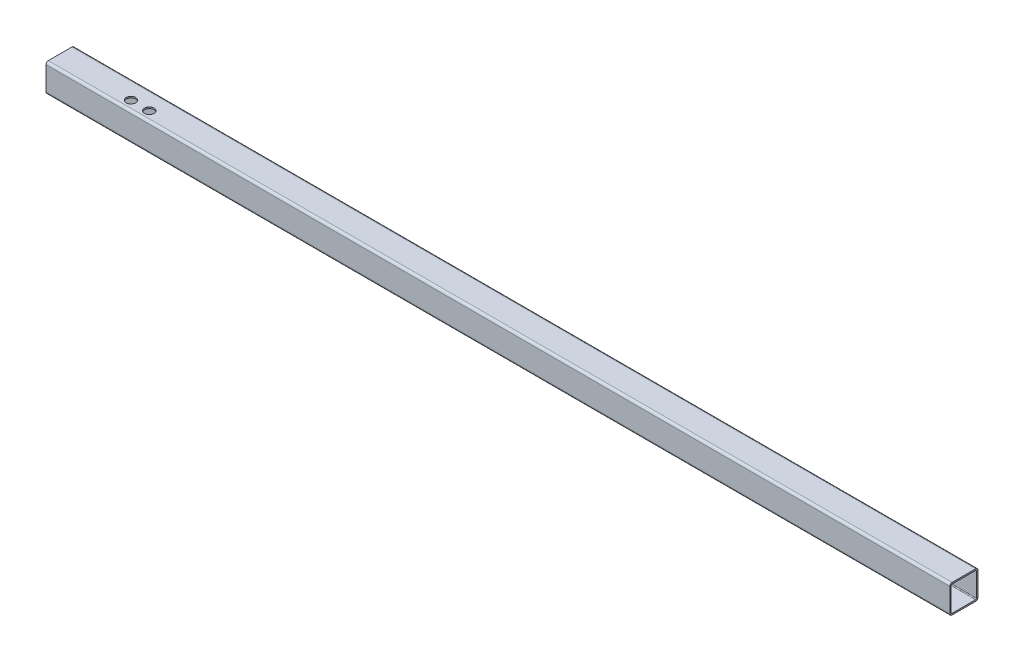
ISO-10303-21;
HEADER;
FILE_DESCRIPTION(('STEP AP214'),'2;1');
FILE_NAME('part.step','',(''),(''),'','','');
FILE_SCHEMA(('AUTOMOTIVE_DESIGN { 1 0 10303 214 1 1 1 1 }'));
ENDSEC;
DATA;
#1=APPLICATION_CONTEXT('core data for automotive mechanical design processes');
#2=APPLICATION_PROTOCOL_DEFINITION('international standard','automotive_design',2000,#1);
#3=PRODUCT_CONTEXT('',#1,'mechanical');
#4=PRODUCT('Part','Part','',(#3));
#5=PRODUCT_RELATED_PRODUCT_CATEGORY('part','',(#4));
#6=PRODUCT_DEFINITION_FORMATION('','',#4);
#7=PRODUCT_DEFINITION_CONTEXT('part definition',#1,'design');
#8=PRODUCT_DEFINITION('design','',#6,#7);
#9=PRODUCT_DEFINITION_SHAPE('','',#8);
#10=(LENGTH_UNIT() NAMED_UNIT(*) SI_UNIT(.MILLI.,.METRE.));
#11=(NAMED_UNIT(*) PLANE_ANGLE_UNIT() SI_UNIT($,.RADIAN.));
#12=(NAMED_UNIT(*) SI_UNIT($,.STERADIAN.) SOLID_ANGLE_UNIT());
#13=UNCERTAINTY_MEASURE_WITH_UNIT(LENGTH_MEASURE(1.E-05),#10,'distance_accuracy_value','');
#14=(GEOMETRIC_REPRESENTATION_CONTEXT(3) GLOBAL_UNCERTAINTY_ASSIGNED_CONTEXT((#13)) GLOBAL_UNIT_ASSIGNED_CONTEXT((#10,
#11,#12)) REPRESENTATION_CONTEXT('',''));
#15=CARTESIAN_POINT('',(0.,0.,0.));
#16=DIRECTION('',(0.,0.,1.));
#17=DIRECTION('',(1.,0.,0.));
#18=AXIS2_PLACEMENT_3D('',#15,#16,#17);
#19=CARTESIAN_POINT('',(609.6,7.90033438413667,24.0360225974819));
#20=DIRECTION('',(1.,0.,0.));
#21=DIRECTION('',(0.,0.,-1.));
#22=AXIS2_PLACEMENT_3D('',#19,#20,#21);
#23=PLANE('',#22);
#24=CARTESIAN_POINT('',(609.6,7.90033438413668,24.0360225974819));
#25=DIRECTION('',(1.,0.,0.));
#26=DIRECTION('',(0.,0.,-1.));
#27=AXIS2_PLACEMENT_3D('',#24,#25,#26);
#28=CIRCLE('',#27,1.55033438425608);
#29=CARTESIAN_POINT('',(609.6,7.90033438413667,25.5863569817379));
#30=VERTEX_POINT('',#29);
#31=CARTESIAN_POINT('',(609.6,6.3499999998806,24.0360225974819));
#32=VERTEX_POINT('',#31);
#33=EDGE_CURVE('E239',#30,#32,#28,.T.);
#34=ORIENTED_EDGE('',*,*,#33,.T.);
#35=DIRECTION('',(0.,0.,-1.));
#36=VECTOR('',#35,1.);
#37=CARTESIAN_POINT('',(609.6,6.3499999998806,24.0360225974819));
#38=LINE('',#37,#36);
#39=CARTESIAN_POINT('',(609.6,6.3499999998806,8.08669136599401));
#40=VERTEX_POINT('',#39);
#41=EDGE_CURVE('E242',#32,#40,#38,.T.);
#42=ORIENTED_EDGE('',*,*,#41,.T.);
#43=CARTESIAN_POINT('',(609.6,7.90033438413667,8.08669136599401));
#44=DIRECTION('',(1.,0.,0.));
#45=DIRECTION('',(0.,0.,-1.));
#46=AXIS2_PLACEMENT_3D('',#43,#44,#45);
#47=CIRCLE('',#46,1.55033438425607);
#48=CARTESIAN_POINT('',(609.6,7.90033438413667,6.53635698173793));
#49=VERTEX_POINT('',#48);
#50=EDGE_CURVE('E161',#40,#49,#47,.T.);
#51=ORIENTED_EDGE('',*,*,#50,.T.);
#52=DIRECTION('',(0.,1.,0.));
#53=VECTOR('',#52,1.);
#54=CARTESIAN_POINT('',(609.6,7.90033438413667,6.53635698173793));
#55=LINE('',#54,#53);
#56=CARTESIAN_POINT('',(609.6,23.8496656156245,6.53635698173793));
#57=VERTEX_POINT('',#56);
#58=EDGE_CURVE('E247',#49,#57,#55,.T.);
#59=ORIENTED_EDGE('',*,*,#58,.T.);
#60=CARTESIAN_POINT('',(609.6,23.8496656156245,8.08669136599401));
#61=DIRECTION('',(1.,0.,0.));
#62=DIRECTION('',(0.,0.,-1.));
#63=AXIS2_PLACEMENT_3D('',#60,#61,#62);
#64=CIRCLE('',#63,1.55033438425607);
#65=CARTESIAN_POINT('',(609.6,25.3999999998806,8.08669136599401));
#66=VERTEX_POINT('',#65);
#67=EDGE_CURVE('E250',#57,#66,#64,.T.);
#68=ORIENTED_EDGE('',*,*,#67,.T.);
#69=DIRECTION('',(0.,0.,1.));
#70=VECTOR('',#69,1.);
#71=CARTESIAN_POINT('',(609.6,25.3999999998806,8.08669136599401));
#72=LINE('',#71,#70);
#73=CARTESIAN_POINT('',(609.6,25.3999999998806,24.0360225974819));
#74=VERTEX_POINT('',#73);
#75=EDGE_CURVE('E253',#66,#74,#72,.T.);
#76=ORIENTED_EDGE('',*,*,#75,.T.);
#77=CARTESIAN_POINT('',(609.6,23.8496656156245,24.0360225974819));
#78=DIRECTION('',(1.,0.,0.));
#79=DIRECTION('',(0.,0.,-1.));
#80=AXIS2_PLACEMENT_3D('',#77,#78,#79);
#81=CIRCLE('',#80,1.55033438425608);
#82=CARTESIAN_POINT('',(609.6,23.8496656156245,25.5863569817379));
#83=VERTEX_POINT('',#82);
#84=EDGE_CURVE('E256',#74,#83,#81,.T.);
#85=ORIENTED_EDGE('',*,*,#84,.T.);
#86=DIRECTION('',(0.,-1.,0.));
#87=VECTOR('',#86,1.);
#88=CARTESIAN_POINT('',(609.6,23.8496656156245,25.5863569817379));
#89=LINE('',#88,#87);
#90=EDGE_CURVE('E259',#83,#30,#89,.T.);
#91=ORIENTED_EDGE('',*,*,#90,.T.);
#92=EDGE_LOOP('',(#34,#42,#51,#59,#68,#76,#85,#91));
#93=FACE_BOUND('',#92,.T.);
#94=DIRECTION('',(0.,1.,0.));
#95=VECTOR('',#94,1.);
#96=CARTESIAN_POINT('',(609.6,7.87399999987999,7.52695698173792));
#97=LINE('',#96,#95);
#98=CARTESIAN_POINT('',(609.6,7.87399999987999,7.52695698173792));
#99=VERTEX_POINT('',#98);
#100=CARTESIAN_POINT('',(609.6,23.8750732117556,7.52695698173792));
#101=VERTEX_POINT('',#100);
#102=EDGE_CURVE('E261',#99,#101,#97,.T.);
#103=ORIENTED_EDGE('',*,*,#102,.F.);
#104=CARTESIAN_POINT('',(609.6,7.87399919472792,8.06035698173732));
#105=DIRECTION('',(1.,0.,0.));
#106=DIRECTION('',(0.,0.,-1.));
#107=AXIS2_PLACEMENT_3D('',#104,#105,#106);
#108=CIRCLE('',#107,0.533400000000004);
#109=CARTESIAN_POINT('',(609.6,7.34059999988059,8.06128376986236));
#110=VERTEX_POINT('',#109);
#111=EDGE_CURVE('E100',#110,#99,#108,.T.);
#112=ORIENTED_EDGE('',*,*,#111,.F.);
#113=DIRECTION('',(0.,0.,-1.));
#114=VECTOR('',#113,1.);
#115=CARTESIAN_POINT('',(609.6,7.3405999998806,24.0623569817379));
#116=LINE('',#115,#114);
#117=CARTESIAN_POINT('',(609.6,7.3405999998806,24.0623569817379));
#118=VERTEX_POINT('',#117);
#119=EDGE_CURVE('E212',#118,#110,#116,.T.);
#120=ORIENTED_EDGE('',*,*,#119,.F.);
#121=CARTESIAN_POINT('',(609.6,7.87399999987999,24.0623577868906));
#122=DIRECTION('',(1.,0.,0.));
#123=DIRECTION('',(0.,0.,-1.));
#124=AXIS2_PLACEMENT_3D('',#121,#122,#123);
#125=CIRCLE('',#124,0.533400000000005);
#126=CARTESIAN_POINT('',(609.6,7.87492678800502,24.5957569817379));
#127=VERTEX_POINT('',#126);
#128=EDGE_CURVE('E266',#127,#118,#125,.T.);
#129=ORIENTED_EDGE('',*,*,#128,.F.);
#130=DIRECTION('',(0.,-1.,0.));
#131=VECTOR('',#130,1.);
#132=CARTESIAN_POINT('',(609.6,23.8759999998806,24.5957569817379));
#133=LINE('',#132,#131);
#134=CARTESIAN_POINT('',(609.6,23.8759999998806,24.5957569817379));
#135=VERTEX_POINT('',#134);
#136=EDGE_CURVE('E268',#135,#127,#133,.T.);
#137=ORIENTED_EDGE('',*,*,#136,.F.);
#138=CARTESIAN_POINT('',(609.6,23.8759999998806,24.0623569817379));
#139=DIRECTION('',(1.,0.,0.));
#140=DIRECTION('',(0.,0.,-1.));
#141=AXIS2_PLACEMENT_3D('',#138,#139,#140);
#142=CIRCLE('',#141,0.533400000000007);
#143=CARTESIAN_POINT('',(609.6,24.4093999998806,24.0623569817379));
#144=VERTEX_POINT('',#143);
#145=EDGE_CURVE('E270',#144,#135,#142,.T.);
#146=ORIENTED_EDGE('',*,*,#145,.F.);
#147=DIRECTION('',(0.,0.,1.));
#148=VECTOR('',#147,1.);
#149=CARTESIAN_POINT('',(609.6,24.4093999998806,8.06128376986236));
#150=LINE('',#149,#148);
#151=CARTESIAN_POINT('',(609.6,24.4093999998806,8.06128376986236));
#152=VERTEX_POINT('',#151);
#153=EDGE_CURVE('E272',#152,#144,#150,.T.);
#154=ORIENTED_EDGE('',*,*,#153,.F.);
#155=CARTESIAN_POINT('',(609.6,23.8760008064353,8.06035617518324));
#156=DIRECTION('',(1.,3.53726020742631E-13,-3.53726020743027E-13));
#157=DIRECTION('',(-3.53726020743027E-13,0.,-1.));
#158=AXIS2_PLACEMENT_3D('',#155,#156,#157);
#159=CIRCLE('',#158,0.533400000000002);
#160=EDGE_CURVE('E263',#101,#152,#159,.T.);
#161=ORIENTED_EDGE('',*,*,#160,.F.);
#162=EDGE_LOOP('',(#103,#112,#120,#129,#137,#146,#154,#161));
#163=FACE_BOUND('',#162,.T.);
#164=ADVANCED_FACE('F40',(#93,#163),#23,.T.);
#165=CARTESIAN_POINT('',(0.,7.90033438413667,24.0360225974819));
#166=DIRECTION('',(1.,0.,0.));
#167=DIRECTION('',(0.,0.,-1.));
#168=AXIS2_PLACEMENT_3D('',#165,#166,#167);
#169=PLANE('',#168);
#170=CARTESIAN_POINT('',(0.,7.90033438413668,24.0360225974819));
#171=DIRECTION('',(1.,0.,0.));
#172=DIRECTION('',(0.,0.,-1.));
#173=AXIS2_PLACEMENT_3D('',#170,#171,#172);
#174=CIRCLE('',#173,1.55033438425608);
#175=CARTESIAN_POINT('',(0.,7.90033438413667,25.5863569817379));
#176=VERTEX_POINT('',#175);
#177=CARTESIAN_POINT('',(0.,6.3499999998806,24.0360225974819));
#178=VERTEX_POINT('',#177);
#179=EDGE_CURVE('E154',#176,#178,#174,.T.);
#180=ORIENTED_EDGE('',*,*,#179,.F.);
#181=DIRECTION('',(0.,-1.,0.));
#182=VECTOR('',#181,1.);
#183=CARTESIAN_POINT('',(0.,23.8496656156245,25.5863569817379));
#184=LINE('',#183,#182);
#185=CARTESIAN_POINT('',(0.,23.8496656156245,25.5863569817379));
#186=VERTEX_POINT('',#185);
#187=EDGE_CURVE('E243',#186,#176,#184,.T.);
#188=ORIENTED_EDGE('',*,*,#187,.F.);
#189=CARTESIAN_POINT('',(0.,23.8496656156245,24.0360225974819));
#190=DIRECTION('',(1.,0.,0.));
#191=DIRECTION('',(0.,0.,-1.));
#192=AXIS2_PLACEMENT_3D('',#189,#190,#191);
#193=CIRCLE('',#192,1.55033438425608);
#194=CARTESIAN_POINT('',(0.,25.3999999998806,24.0360225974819));
#195=VERTEX_POINT('',#194);
#196=EDGE_CURVE('E279',#195,#186,#193,.T.);
#197=ORIENTED_EDGE('',*,*,#196,.F.);
#198=DIRECTION('',(0.,0.,1.));
#199=VECTOR('',#198,1.);
#200=CARTESIAN_POINT('',(0.,25.3999999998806,8.08669136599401));
#201=LINE('',#200,#199);
#202=CARTESIAN_POINT('',(0.,25.3999999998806,8.08669136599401));
#203=VERTEX_POINT('',#202);
#204=EDGE_CURVE('E281',#203,#195,#201,.T.);
#205=ORIENTED_EDGE('',*,*,#204,.F.);
#206=CARTESIAN_POINT('',(0.,23.8496656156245,8.08669136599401));
#207=DIRECTION('',(1.,0.,0.));
#208=DIRECTION('',(0.,0.,-1.));
#209=AXIS2_PLACEMENT_3D('',#206,#207,#208);
#210=CIRCLE('',#209,1.55033438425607);
#211=CARTESIAN_POINT('',(0.,23.8496656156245,6.53635698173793));
#212=VERTEX_POINT('',#211);
#213=EDGE_CURVE('E170',#212,#203,#210,.T.);
#214=ORIENTED_EDGE('',*,*,#213,.F.);
#215=DIRECTION('',(0.,1.,0.));
#216=VECTOR('',#215,1.);
#217=CARTESIAN_POINT('',(0.,7.90033438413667,6.53635698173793));
#218=LINE('',#217,#216);
#219=CARTESIAN_POINT('',(0.,7.90033438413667,6.53635698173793));
#220=VERTEX_POINT('',#219);
#221=EDGE_CURVE('E168',#220,#212,#218,.T.);
#222=ORIENTED_EDGE('',*,*,#221,.F.);
#223=CARTESIAN_POINT('',(0.,7.90033438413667,8.08669136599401));
#224=DIRECTION('',(1.,0.,0.));
#225=DIRECTION('',(0.,0.,-1.));
#226=AXIS2_PLACEMENT_3D('',#223,#224,#225);
#227=CIRCLE('',#226,1.55033438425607);
#228=CARTESIAN_POINT('',(0.,6.3499999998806,8.08669136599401));
#229=VERTEX_POINT('',#228);
#230=EDGE_CURVE('E153',#229,#220,#227,.T.);
#231=ORIENTED_EDGE('',*,*,#230,.F.);
#232=DIRECTION('',(0.,0.,-1.));
#233=VECTOR('',#232,1.);
#234=CARTESIAN_POINT('',(0.,6.3499999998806,24.0360225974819));
#235=LINE('',#234,#233);
#236=EDGE_CURVE('E143',#178,#229,#235,.T.);
#237=ORIENTED_EDGE('',*,*,#236,.F.);
#238=EDGE_LOOP('',(#180,#188,#197,#205,#214,#222,#231,#237));
#239=FACE_BOUND('',#238,.T.);
#240=CARTESIAN_POINT('',(0.,7.87399919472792,8.06035698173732));
#241=DIRECTION('',(1.,0.,0.));
#242=DIRECTION('',(0.,0.,-1.));
#243=AXIS2_PLACEMENT_3D('',#240,#241,#242);
#244=CIRCLE('',#243,0.533400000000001);
#245=CARTESIAN_POINT('',(0.,7.34059999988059,8.06128376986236));
#246=VERTEX_POINT('',#245);
#247=CARTESIAN_POINT('',(0.,7.87399999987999,7.52695698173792));
#248=VERTEX_POINT('',#247);
#249=EDGE_CURVE('E66',#246,#248,#244,.T.);
#250=ORIENTED_EDGE('',*,*,#249,.T.);
#251=DIRECTION('',(0.,1.,0.));
#252=VECTOR('',#251,1.);
#253=CARTESIAN_POINT('',(0.,7.87399999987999,7.52695698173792));
#254=LINE('',#253,#252);
#255=CARTESIAN_POINT('',(0.,23.8750732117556,7.52695698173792));
#256=VERTEX_POINT('',#255);
#257=EDGE_CURVE('E175',#248,#256,#254,.T.);
#258=ORIENTED_EDGE('',*,*,#257,.T.);
#259=CARTESIAN_POINT('',(0.,23.8760008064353,8.06035617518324));
#260=DIRECTION('',(1.,0.,0.));
#261=DIRECTION('',(0.,0.,-1.));
#262=AXIS2_PLACEMENT_3D('',#259,#260,#261);
#263=CIRCLE('',#262,0.533400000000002);
#264=CARTESIAN_POINT('',(0.,24.4093999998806,8.06128376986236));
#265=VERTEX_POINT('',#264);
#266=EDGE_CURVE('E178',#256,#265,#263,.T.);
#267=ORIENTED_EDGE('',*,*,#266,.T.);
#268=DIRECTION('',(0.,0.,1.));
#269=VECTOR('',#268,1.);
#270=CARTESIAN_POINT('',(0.,24.4093999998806,8.06128376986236));
#271=LINE('',#270,#269);
#272=CARTESIAN_POINT('',(0.,24.4093999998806,24.0623569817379));
#273=VERTEX_POINT('',#272);
#274=EDGE_CURVE('E181',#265,#273,#271,.T.);
#275=ORIENTED_EDGE('',*,*,#274,.T.);
#276=CARTESIAN_POINT('',(0.,23.8759999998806,24.0623569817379));
#277=DIRECTION('',(1.,0.,0.));
#278=DIRECTION('',(0.,0.,-1.));
#279=AXIS2_PLACEMENT_3D('',#276,#277,#278);
#280=CIRCLE('',#279,0.533400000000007);
#281=CARTESIAN_POINT('',(0.,23.8759999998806,24.5957569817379));
#282=VERTEX_POINT('',#281);
#283=EDGE_CURVE('E184',#273,#282,#280,.T.);
#284=ORIENTED_EDGE('',*,*,#283,.T.);
#285=DIRECTION('',(0.,-1.,0.));
#286=VECTOR('',#285,1.);
#287=CARTESIAN_POINT('',(0.,23.8759999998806,24.5957569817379));
#288=LINE('',#287,#286);
#289=CARTESIAN_POINT('',(0.,7.87492678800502,24.5957569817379));
#290=VERTEX_POINT('',#289);
#291=EDGE_CURVE('E187',#282,#290,#288,.T.);
#292=ORIENTED_EDGE('',*,*,#291,.T.);
#293=CARTESIAN_POINT('',(0.,7.87399999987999,24.0623577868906));
#294=DIRECTION('',(1.,0.,0.));
#295=DIRECTION('',(0.,0.,-1.));
#296=AXIS2_PLACEMENT_3D('',#293,#294,#295);
#297=CIRCLE('',#296,0.533400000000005);
#298=CARTESIAN_POINT('',(0.,7.34059999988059,24.0623569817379));
#299=VERTEX_POINT('',#298);
#300=EDGE_CURVE('E190',#290,#299,#297,.T.);
#301=ORIENTED_EDGE('',*,*,#300,.T.);
#302=DIRECTION('',(0.,0.,-1.));
#303=VECTOR('',#302,1.);
#304=CARTESIAN_POINT('',(0.,7.3405999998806,24.0623569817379));
#305=LINE('',#304,#303);
#306=EDGE_CURVE('E193',#299,#246,#305,.T.);
#307=ORIENTED_EDGE('',*,*,#306,.T.);
#308=EDGE_LOOP('',(#250,#258,#267,#275,#284,#292,#301,#307));
#309=FACE_BOUND('',#308,.T.);
#310=ADVANCED_FACE('F165',(#239,#309),#169,.F.);
#311=CARTESIAN_POINT('',(609.6,7.90033438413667,24.0360225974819));
#312=DIRECTION('',(-1.,0.,0.));
#313=DIRECTION('',(0.,-1.,0.));
#314=AXIS2_PLACEMENT_3D('',#311,#312,#313);
#315=CYLINDRICAL_SURFACE('',#314,1.55033438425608);
#316=ORIENTED_EDGE('',*,*,#179,.T.);
#317=DIRECTION('',(-1.,0.,0.));
#318=VECTOR('',#317,1.);
#319=CARTESIAN_POINT('',(609.6,6.3499999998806,24.0360225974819));
#320=LINE('',#319,#318);
#321=EDGE_CURVE('E11',#32,#178,#320,.T.);
#322=ORIENTED_EDGE('',*,*,#321,.F.);
#323=ORIENTED_EDGE('',*,*,#33,.F.);
#324=DIRECTION('',(-1.,0.,0.));
#325=VECTOR('',#324,1.);
#326=CARTESIAN_POINT('',(609.6,7.90033438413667,25.5863569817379));
#327=LINE('',#326,#325);
#328=EDGE_CURVE('E209',#30,#176,#327,.T.);
#329=ORIENTED_EDGE('',*,*,#328,.T.);
#330=EDGE_LOOP('',(#316,#322,#323,#329));
#331=FACE_BOUND('',#330,.T.);
#332=ADVANCED_FACE('F332',(#331),#315,.T.);
#333=CARTESIAN_POINT('',(609.6,6.3499999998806,24.0360225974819));
#334=DIRECTION('',(0.,1.,0.));
#335=DIRECTION('',(0.,0.,1.));
#336=AXIS2_PLACEMENT_3D('',#333,#334,#335);
#337=PLANE('',#336);
#338=ORIENTED_EDGE('',*,*,#236,.T.);
#339=DIRECTION('',(-1.,0.,0.));
#340=VECTOR('',#339,1.);
#341=CARTESIAN_POINT('',(609.6,6.3499999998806,8.08669136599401));
#342=LINE('',#341,#340);
#343=EDGE_CURVE('E49',#40,#229,#342,.T.);
#344=ORIENTED_EDGE('',*,*,#343,.F.);
#345=ORIENTED_EDGE('',*,*,#41,.F.);
#346=ORIENTED_EDGE('',*,*,#321,.T.);
#347=EDGE_LOOP('',(#338,#344,#345,#346));
#348=FACE_BOUND('',#347,.T.);
#349=ADVANCED_FACE('F147',(#348),#337,.F.);
#350=CARTESIAN_POINT('',(609.6,7.90033438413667,8.08669136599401));
#351=DIRECTION('',(-1.,0.,0.));
#352=DIRECTION('',(0.,-1.,0.));
#353=AXIS2_PLACEMENT_3D('',#350,#351,#352);
#354=CYLINDRICAL_SURFACE('',#353,1.55033438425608);
#355=ORIENTED_EDGE('',*,*,#230,.T.);
#356=DIRECTION('',(-1.,0.,0.));
#357=VECTOR('',#356,1.);
#358=CARTESIAN_POINT('',(609.6,7.90033438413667,6.53635698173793));
#359=LINE('',#358,#357);
#360=EDGE_CURVE('E162',#49,#220,#359,.T.);
#361=ORIENTED_EDGE('',*,*,#360,.F.);
#362=ORIENTED_EDGE('',*,*,#50,.F.);
#363=ORIENTED_EDGE('',*,*,#343,.T.);
#364=EDGE_LOOP('',(#355,#361,#362,#363));
#365=FACE_BOUND('',#364,.T.);
#366=ADVANCED_FACE('F157',(#365),#354,.T.);
#367=CARTESIAN_POINT('',(609.6,7.90033438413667,6.53635698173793));
#368=DIRECTION('',(0.,0.,1.));
#369=DIRECTION('',(0.,-1.,0.));
#370=AXIS2_PLACEMENT_3D('',#367,#368,#369);
#371=PLANE('',#370);
#372=ORIENTED_EDGE('',*,*,#221,.T.);
#373=DIRECTION('',(-1.,0.,0.));
#374=VECTOR('',#373,1.);
#375=CARTESIAN_POINT('',(609.6,23.8496656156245,6.53635698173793));
#376=LINE('',#375,#374);
#377=EDGE_CURVE('E197',#57,#212,#376,.T.);
#378=ORIENTED_EDGE('',*,*,#377,.F.);
#379=ORIENTED_EDGE('',*,*,#58,.F.);
#380=ORIENTED_EDGE('',*,*,#360,.T.);
#381=EDGE_LOOP('',(#372,#378,#379,#380));
#382=FACE_BOUND('',#381,.T.);
#383=ADVANCED_FACE('F318',(#382),#371,.F.);
#384=CARTESIAN_POINT('',(609.6,23.8496656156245,8.08669136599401));
#385=DIRECTION('',(-1.,0.,0.));
#386=DIRECTION('',(0.,-1.,0.));
#387=AXIS2_PLACEMENT_3D('',#384,#385,#386);
#388=CYLINDRICAL_SURFACE('',#387,1.55033438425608);
#389=ORIENTED_EDGE('',*,*,#213,.T.);
#390=DIRECTION('',(-1.,0.,0.));
#391=VECTOR('',#390,1.);
#392=CARTESIAN_POINT('',(609.6,25.3999999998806,8.08669136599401));
#393=LINE('',#392,#391);
#394=EDGE_CURVE('E200',#66,#203,#393,.T.);
#395=ORIENTED_EDGE('',*,*,#394,.F.);
#396=ORIENTED_EDGE('',*,*,#67,.F.);
#397=ORIENTED_EDGE('',*,*,#377,.T.);
#398=EDGE_LOOP('',(#389,#395,#396,#397));
#399=FACE_BOUND('',#398,.T.);
#400=ADVANCED_FACE('F284',(#399),#388,.T.);
#401=CARTESIAN_POINT('',(609.6,25.3999999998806,8.08669136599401));
#402=DIRECTION('',(0.,-1.,0.));
#403=DIRECTION('',(0.,0.,-1.));
#404=AXIS2_PLACEMENT_3D('',#401,#402,#403);
#405=PLANE('',#404);
#406=CARTESIAN_POINT('',(50.9509002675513,25.3999999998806,19.2363569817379));
#407=DIRECTION('',(0.,1.,0.));
#408=DIRECTION('',(0.,0.,1.));
#409=AXIS2_PLACEMENT_3D('',#406,#407,#408);
#410=CIRCLE('',#409,3.175);
#411=CARTESIAN_POINT('',(50.9509002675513,25.3999999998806,22.4113569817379));
#412=VERTEX_POINT('',#411);
#413=EDGE_CURVE('E227',#412,#412,#410,.T.);
#414=ORIENTED_EDGE('',*,*,#413,.F.);
#415=EDGE_LOOP('',(#414));
#416=FACE_BOUND('',#415,.T.);
#417=CARTESIAN_POINT('',(63.3490997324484,25.3999999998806,19.2363569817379));
#418=DIRECTION('',(0.,1.,0.));
#419=DIRECTION('',(0.,0.,1.));
#420=AXIS2_PLACEMENT_3D('',#417,#418,#419);
#421=CIRCLE('',#420,3.175);
#422=CARTESIAN_POINT('',(63.3490997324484,25.3999999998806,22.4113569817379));
#423=VERTEX_POINT('',#422);
#424=EDGE_CURVE('E232',#423,#423,#421,.T.);
#425=ORIENTED_EDGE('',*,*,#424,.F.);
#426=EDGE_LOOP('',(#425));
#427=FACE_BOUND('',#426,.T.);
#428=ORIENTED_EDGE('',*,*,#204,.T.);
#429=DIRECTION('',(-1.,0.,0.));
#430=VECTOR('',#429,1.);
#431=CARTESIAN_POINT('',(609.6,25.3999999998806,24.0360225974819));
#432=LINE('',#431,#430);
#433=EDGE_CURVE('E203',#74,#195,#432,.T.);
#434=ORIENTED_EDGE('',*,*,#433,.F.);
#435=ORIENTED_EDGE('',*,*,#75,.F.);
#436=ORIENTED_EDGE('',*,*,#394,.T.);
#437=EDGE_LOOP('',(#428,#434,#435,#436));
#438=FACE_BOUND('',#437,.T.);
#439=ADVANCED_FACE('F291',(#416,#427,#438),#405,.F.);
#440=CARTESIAN_POINT('',(609.6,23.8496656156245,24.0360225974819));
#441=DIRECTION('',(-1.,0.,0.));
#442=DIRECTION('',(0.,-1.,0.));
#443=AXIS2_PLACEMENT_3D('',#440,#441,#442);
#444=CYLINDRICAL_SURFACE('',#443,1.55033438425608);
#445=ORIENTED_EDGE('',*,*,#196,.T.);
#446=DIRECTION('',(-1.,0.,0.));
#447=VECTOR('',#446,1.);
#448=CARTESIAN_POINT('',(609.6,23.8496656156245,25.5863569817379));
#449=LINE('',#448,#447);
#450=EDGE_CURVE('E206',#83,#186,#449,.T.);
#451=ORIENTED_EDGE('',*,*,#450,.F.);
#452=ORIENTED_EDGE('',*,*,#84,.F.);
#453=ORIENTED_EDGE('',*,*,#433,.T.);
#454=EDGE_LOOP('',(#445,#451,#452,#453));
#455=FACE_BOUND('',#454,.T.);
#456=ADVANCED_FACE('F297',(#455),#444,.T.);
#457=CARTESIAN_POINT('',(609.6,23.8496656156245,25.5863569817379));
#458=DIRECTION('',(0.,0.,-1.));
#459=DIRECTION('',(0.,1.,0.));
#460=AXIS2_PLACEMENT_3D('',#457,#458,#459);
#461=PLANE('',#460);
#462=ORIENTED_EDGE('',*,*,#187,.T.);
#463=ORIENTED_EDGE('',*,*,#328,.F.);
#464=ORIENTED_EDGE('',*,*,#90,.F.);
#465=ORIENTED_EDGE('',*,*,#450,.T.);
#466=EDGE_LOOP('',(#462,#463,#464,#465));
#467=FACE_BOUND('',#466,.T.);
#468=ADVANCED_FACE('F301',(#467),#461,.F.);
#469=CARTESIAN_POINT('',(609.6,7.87399919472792,8.06035698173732));
#470=DIRECTION('',(-1.,-1.04070399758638E-13,0.));
#471=DIRECTION('',(1.04070399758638E-13,-1.,0.));
#472=AXIS2_PLACEMENT_3D('',#469,#470,#471);
#473=CYLINDRICAL_SURFACE('',#472,0.533400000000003);
#474=ORIENTED_EDGE('',*,*,#249,.F.);
#475=DIRECTION('',(-1.,0.,0.));
#476=VECTOR('',#475,1.);
#477=CARTESIAN_POINT('',(609.6,7.34059999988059,8.06128376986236));
#478=LINE('',#477,#476);
#479=EDGE_CURVE('E210',#110,#246,#478,.T.);
#480=ORIENTED_EDGE('',*,*,#479,.F.);
#481=ORIENTED_EDGE('',*,*,#111,.T.);
#482=DIRECTION('',(-1.,0.,0.));
#483=VECTOR('',#482,1.);
#484=CARTESIAN_POINT('',(609.6,7.87399999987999,7.52695698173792));
#485=LINE('',#484,#483);
#486=EDGE_CURVE('E213',#99,#248,#485,.T.);
#487=ORIENTED_EDGE('',*,*,#486,.T.);
#488=EDGE_LOOP('',(#474,#480,#481,#487));
#489=FACE_BOUND('',#488,.T.);
#490=ADVANCED_FACE('F421',(#489),#473,.F.);
#491=CARTESIAN_POINT('',(609.6,7.87399999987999,7.52695698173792));
#492=DIRECTION('',(0.,0.,1.));
#493=DIRECTION('',(0.,-1.,0.));
#494=AXIS2_PLACEMENT_3D('',#491,#492,#493);
#495=PLANE('',#494);
#496=ORIENTED_EDGE('',*,*,#257,.F.);
#497=ORIENTED_EDGE('',*,*,#486,.F.);
#498=ORIENTED_EDGE('',*,*,#102,.T.);
#499=DIRECTION('',(-1.,0.,0.));
#500=VECTOR('',#499,1.);
#501=CARTESIAN_POINT('',(609.6,23.8750732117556,7.52695698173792));
#502=LINE('',#501,#500);
#503=EDGE_CURVE('E215',#101,#256,#502,.T.);
#504=ORIENTED_EDGE('',*,*,#503,.T.);
#505=EDGE_LOOP('',(#496,#497,#498,#504));
#506=FACE_BOUND('',#505,.T.);
#507=ADVANCED_FACE('F411',(#506),#495,.T.);
#508=CARTESIAN_POINT('',(609.6,23.8760008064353,8.06035617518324));
#509=DIRECTION('',(-1.,-1.04070399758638E-13,0.));
#510=DIRECTION('',(1.04070399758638E-13,-1.,0.));
#511=AXIS2_PLACEMENT_3D('',#508,#509,#510);
#512=CYLINDRICAL_SURFACE('',#511,0.533400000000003);
#513=ORIENTED_EDGE('',*,*,#266,.F.);
#514=ORIENTED_EDGE('',*,*,#503,.F.);
#515=ORIENTED_EDGE('',*,*,#160,.T.);
#516=DIRECTION('',(-1.,0.,0.));
#517=VECTOR('',#516,1.);
#518=CARTESIAN_POINT('',(609.6,24.4093999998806,8.06128376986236));
#519=LINE('',#518,#517);
#520=EDGE_CURVE('E217',#152,#265,#519,.T.);
#521=ORIENTED_EDGE('',*,*,#520,.T.);
#522=EDGE_LOOP('',(#513,#514,#515,#521));
#523=FACE_BOUND('',#522,.T.);
#524=ADVANCED_FACE('F401',(#523),#512,.F.);
#525=CARTESIAN_POINT('',(609.6,24.4093999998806,8.06128376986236));
#526=DIRECTION('',(0.,-1.,0.));
#527=DIRECTION('',(0.,0.,-1.));
#528=AXIS2_PLACEMENT_3D('',#525,#526,#527);
#529=PLANE('',#528);
#530=CARTESIAN_POINT('',(50.9509002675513,24.4093999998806,19.2363569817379));
#531=DIRECTION('',(0.,-1.,0.));
#532=DIRECTION('',(0.,0.,-1.));
#533=AXIS2_PLACEMENT_3D('',#530,#531,#532);
#534=CIRCLE('',#533,3.175);
#535=CARTESIAN_POINT('',(50.9509002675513,24.4093999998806,16.0613569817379));
#536=VERTEX_POINT('',#535);
#537=EDGE_CURVE('E44',#536,#536,#534,.T.);
#538=ORIENTED_EDGE('',*,*,#537,.F.);
#539=EDGE_LOOP('',(#538));
#540=FACE_BOUND('',#539,.T.);
#541=CARTESIAN_POINT('',(63.3490997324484,24.4093999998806,19.2363569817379));
#542=DIRECTION('',(0.,-1.,0.));
#543=DIRECTION('',(0.,0.,-1.));
#544=AXIS2_PLACEMENT_3D('',#541,#542,#543);
#545=CIRCLE('',#544,3.175);
#546=CARTESIAN_POINT('',(63.3490997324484,24.4093999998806,16.0613569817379));
#547=VERTEX_POINT('',#546);
#548=EDGE_CURVE('E225',#547,#547,#545,.T.);
#549=ORIENTED_EDGE('',*,*,#548,.F.);
#550=EDGE_LOOP('',(#549));
#551=FACE_BOUND('',#550,.T.);
#552=ORIENTED_EDGE('',*,*,#274,.F.);
#553=ORIENTED_EDGE('',*,*,#520,.F.);
#554=ORIENTED_EDGE('',*,*,#153,.T.);
#555=DIRECTION('',(-1.,0.,0.));
#556=VECTOR('',#555,1.);
#557=CARTESIAN_POINT('',(609.6,24.4093999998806,24.0623569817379));
#558=LINE('',#557,#556);
#559=EDGE_CURVE('E219',#144,#273,#558,.T.);
#560=ORIENTED_EDGE('',*,*,#559,.T.);
#561=EDGE_LOOP('',(#552,#553,#554,#560));
#562=FACE_BOUND('',#561,.T.);
#563=ADVANCED_FACE('F390',(#540,#551,#562),#529,.T.);
#564=CARTESIAN_POINT('',(609.6,23.8759999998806,24.0623569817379));
#565=DIRECTION('',(-1.,-1.04070399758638E-13,0.));
#566=DIRECTION('',(1.04070399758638E-13,-1.,0.));
#567=AXIS2_PLACEMENT_3D('',#564,#565,#566);
#568=CYLINDRICAL_SURFACE('',#567,0.533400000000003);
#569=ORIENTED_EDGE('',*,*,#283,.F.);
#570=ORIENTED_EDGE('',*,*,#559,.F.);
#571=ORIENTED_EDGE('',*,*,#145,.T.);
#572=DIRECTION('',(-1.,0.,0.));
#573=VECTOR('',#572,1.);
#574=CARTESIAN_POINT('',(609.6,23.8759999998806,24.5957569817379));
#575=LINE('',#574,#573);
#576=EDGE_CURVE('E221',#135,#282,#575,.T.);
#577=ORIENTED_EDGE('',*,*,#576,.T.);
#578=EDGE_LOOP('',(#569,#570,#571,#577));
#579=FACE_BOUND('',#578,.T.);
#580=ADVANCED_FACE('F380',(#579),#568,.F.);
#581=CARTESIAN_POINT('',(609.6,23.8759999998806,24.5957569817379));
#582=DIRECTION('',(0.,0.,-1.));
#583=DIRECTION('',(-1.,0.,0.));
#584=AXIS2_PLACEMENT_3D('',#581,#582,#583);
#585=PLANE('',#584);
#586=ORIENTED_EDGE('',*,*,#291,.F.);
#587=ORIENTED_EDGE('',*,*,#576,.F.);
#588=ORIENTED_EDGE('',*,*,#136,.T.);
#589=DIRECTION('',(-1.,0.,0.));
#590=VECTOR('',#589,1.);
#591=CARTESIAN_POINT('',(609.6,7.87492678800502,24.5957569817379));
#592=LINE('',#591,#590);
#593=EDGE_CURVE('E223',#127,#290,#592,.T.);
#594=ORIENTED_EDGE('',*,*,#593,.T.);
#595=EDGE_LOOP('',(#586,#587,#588,#594));
#596=FACE_BOUND('',#595,.T.);
#597=ADVANCED_FACE('F372',(#596),#585,.T.);
#598=CARTESIAN_POINT('',(609.6,7.87399999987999,24.0623577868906));
#599=DIRECTION('',(-1.,-1.04070399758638E-13,0.));
#600=DIRECTION('',(1.04070399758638E-13,-1.,0.));
#601=AXIS2_PLACEMENT_3D('',#598,#599,#600);
#602=CYLINDRICAL_SURFACE('',#601,0.533400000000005);
#603=ORIENTED_EDGE('',*,*,#300,.F.);
#604=ORIENTED_EDGE('',*,*,#593,.F.);
#605=ORIENTED_EDGE('',*,*,#128,.T.);
#606=DIRECTION('',(-1.,0.,0.));
#607=VECTOR('',#606,1.);
#608=CARTESIAN_POINT('',(609.6,7.34059999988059,24.0623569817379));
#609=LINE('',#608,#607);
#610=EDGE_CURVE('E57',#118,#299,#609,.T.);
#611=ORIENTED_EDGE('',*,*,#610,.T.);
#612=EDGE_LOOP('',(#603,#604,#605,#611));
#613=FACE_BOUND('',#612,.T.);
#614=ADVANCED_FACE('F363',(#613),#602,.F.);
#615=CARTESIAN_POINT('',(609.6,7.3405999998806,24.0623569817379));
#616=DIRECTION('',(0.,1.,0.));
#617=DIRECTION('',(0.,0.,1.));
#618=AXIS2_PLACEMENT_3D('',#615,#616,#617);
#619=PLANE('',#618);
#620=ORIENTED_EDGE('',*,*,#306,.F.);
#621=ORIENTED_EDGE('',*,*,#610,.F.);
#622=ORIENTED_EDGE('',*,*,#119,.T.);
#623=ORIENTED_EDGE('',*,*,#479,.T.);
#624=EDGE_LOOP('',(#620,#621,#622,#623));
#625=FACE_BOUND('',#624,.T.);
#626=ADVANCED_FACE('F42',(#625),#619,.T.);
#627=CARTESIAN_POINT('',(63.3490997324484,22.8599999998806,19.2363569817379));
#628=DIRECTION('',(0.,1.,0.));
#629=DIRECTION('',(0.,0.,1.));
#630=AXIS2_PLACEMENT_3D('',#627,#628,#629);
#631=CYLINDRICAL_SURFACE('',#630,3.175);
#632=ORIENTED_EDGE('',*,*,#548,.T.);
#633=EDGE_LOOP('',(#632));
#634=FACE_BOUND('',#633,.T.);
#635=ORIENTED_EDGE('',*,*,#424,.T.);
#636=EDGE_LOOP('',(#635));
#637=FACE_BOUND('',#636,.T.);
#638=ADVANCED_FACE('F335',(#634,#637),#631,.F.);
#639=CARTESIAN_POINT('',(50.9509002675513,22.8599999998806,19.2363569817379));
#640=DIRECTION('',(0.,1.,0.));
#641=DIRECTION('',(0.,0.,1.));
#642=AXIS2_PLACEMENT_3D('',#639,#640,#641);
#643=CYLINDRICAL_SURFACE('',#642,3.175);
#644=ORIENTED_EDGE('',*,*,#537,.T.);
#645=EDGE_LOOP('',(#644));
#646=FACE_BOUND('',#645,.T.);
#647=ORIENTED_EDGE('',*,*,#413,.T.);
#648=EDGE_LOOP('',(#647));
#649=FACE_BOUND('',#648,.T.);
#650=ADVANCED_FACE('F477',(#646,#649),#643,.F.);
#651=CLOSED_SHELL('',(#164,#310,#332,#349,#366,#383,#400,#439,#456,#468,#490,#507,#524,#563,
#580,#597,#614,#626,#638,#650));
#652=MANIFOLD_SOLID_BREP('B2',#651);
#653=ADVANCED_BREP_SHAPE_REPRESENTATION('',(#18,#652),#14);
#654=SHAPE_DEFINITION_REPRESENTATION(#9,#653);
ENDSEC;
END-ISO-10303-21;
